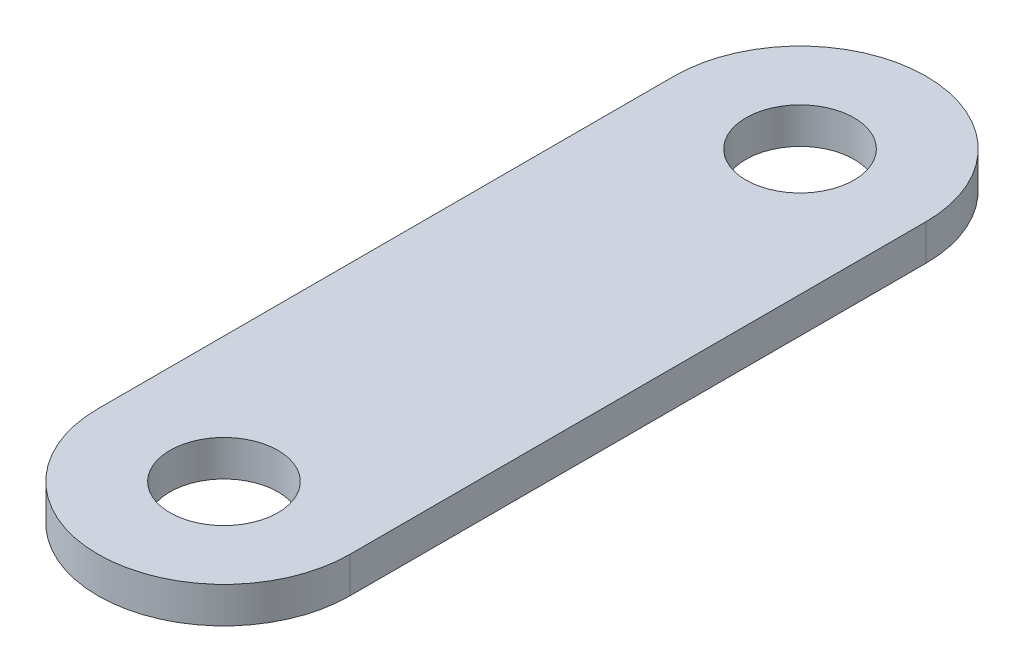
from build123d import *

# Parameters (mm, degrees)
SKETCH1_R           = 1.5
BOSS_EXTRUDE1_DEPTH = 1


with BuildPart() as part:
    # Sketch1 → Boss-Extrude1 (new body)
    with BuildSketch(Plane(origin=(0, 0, 0), x_dir=(1, 0, 0), z_dir=(0, 1, 0))):
        with BuildLine():
            Line((-3.5, 8), (-3.5, 0))
            Line((-3.5, 0), (3.5, 0))
            Line((3.5, 0), (3.5, 8))
            ThreePointArc((3.5, 8), (0, 11.5), (-3.5, 8))
        make_face()
        with Locations(Location((0, 8, 0), (0, 0, 270))):
            Circle(SKETCH1_R, mode=Mode.SUBTRACT)
    extrude(amount=BOSS_EXTRUDE1_DEPTH)

    # Mirror1: part across plane


with BuildPart() as part_1:
    add(part.part)
    add(part.part.mirror(Plane(origin=(-3.5, 1, 0), x_dir=(1, 0, 0), z_dir=(0, 0, -1))))


solid = part_1.part
